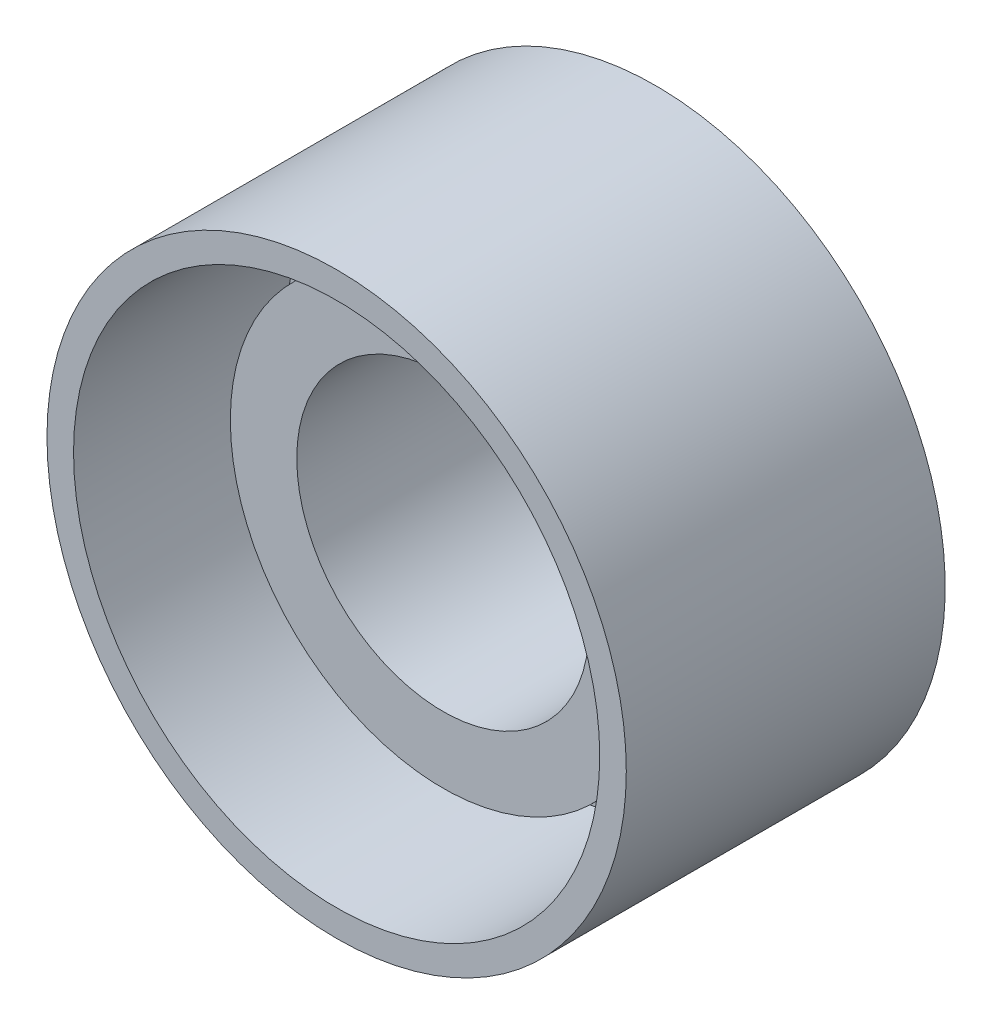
from build123d import *

# Parameters (mm, degrees)
SKETCH_1_R          = 54.5
SKETCH_1_R_2        = 49.5
EXTRUDE_1_DEPTH     = 40
SKETCH_2_R          = 40
EXTRUDE_2_DEPTH     = 20
EXTRUDE_START       = 20
SKETCH_3_R          = 54.5
EXTRUDE_3_DEPTH     = 20
SKETCH_4_R          = 27.5
CUT_EXTRUDE_1_DEPTH = 98.675483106


with BuildPart() as part:
    # Sketch 1 → Extrude 1 (new body)
    with BuildSketch(Plane.XY):
        Circle(SKETCH_1_R)
        Circle(SKETCH_1_R_2, mode=Mode.SUBTRACT)
    extrude(amount=EXTRUDE_1_DEPTH)



with BuildPart() as body_2:
    # Sketch 2 → Extrude 2 (new body)
    with BuildSketch(Plane.XY):
        Circle(SKETCH_2_R)
    extrude(amount=EXTRUDE_2_DEPTH)


with BuildPart() as part_1:
    add(part.part)

    add(body_2.part)  # Extrude 3 merges body 2
    # Sketch 3 → Extrude 3 (add)
    with BuildSketch(Plane(origin=(0, 0, 0), x_dir=(-1, 0, 0), z_dir=(0, 0, -1)).offset(EXTRUDE_START)):
        Circle(SKETCH_3_R)
    extrude(amount=-EXTRUDE_3_DEPTH)

    # Sketch 4 → Cut-Extrude 1 (cut, through all)
    with BuildSketch(Plane(origin=(0, 0, -20), x_dir=(-1, 0, 0), z_dir=(0, 0, -1))):
        Circle(SKETCH_4_R)
    extrude(amount=-CUT_EXTRUDE_1_DEPTH, mode=Mode.SUBTRACT)


solid = part_1.part
